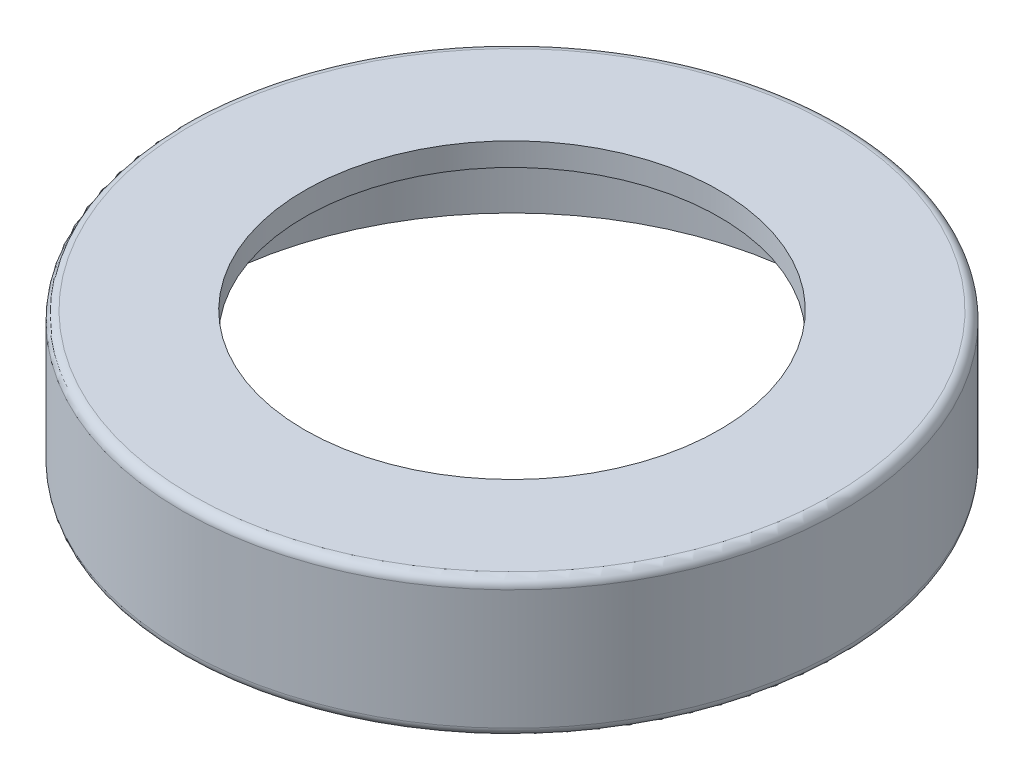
ISO-10303-21;
HEADER;
FILE_DESCRIPTION(('STEP AP214'),'2;1');
FILE_NAME('part.step','',(''),(''),'','','');
FILE_SCHEMA(('AUTOMOTIVE_DESIGN { 1 0 10303 214 1 1 1 1 }'));
ENDSEC;
DATA;
#1=APPLICATION_CONTEXT('core data for automotive mechanical design processes');
#2=APPLICATION_PROTOCOL_DEFINITION('international standard','automotive_design',2000,#1);
#3=PRODUCT_CONTEXT('',#1,'mechanical');
#4=PRODUCT('Part','Part','',(#3));
#5=PRODUCT_RELATED_PRODUCT_CATEGORY('part','',(#4));
#6=PRODUCT_DEFINITION_FORMATION('','',#4);
#7=PRODUCT_DEFINITION_CONTEXT('part definition',#1,'design');
#8=PRODUCT_DEFINITION('design','',#6,#7);
#9=PRODUCT_DEFINITION_SHAPE('','',#8);
#10=(LENGTH_UNIT() NAMED_UNIT(*) SI_UNIT(.MILLI.,.METRE.));
#11=(NAMED_UNIT(*) PLANE_ANGLE_UNIT() SI_UNIT($,.RADIAN.));
#12=(NAMED_UNIT(*) SI_UNIT($,.STERADIAN.) SOLID_ANGLE_UNIT());
#13=UNCERTAINTY_MEASURE_WITH_UNIT(LENGTH_MEASURE(1.E-05),#10,'distance_accuracy_value','');
#14=(GEOMETRIC_REPRESENTATION_CONTEXT(3) GLOBAL_UNCERTAINTY_ASSIGNED_CONTEXT((#13)) GLOBAL_UNIT_ASSIGNED_CONTEXT((#10,
#11,#12)) REPRESENTATION_CONTEXT('',''));
#15=CARTESIAN_POINT('',(0.,0.,0.));
#16=DIRECTION('',(0.,0.,1.));
#17=DIRECTION('',(1.,0.,0.));
#18=AXIS2_PLACEMENT_3D('',#15,#16,#17);
#19=CARTESIAN_POINT('',(6.95,3.,0.));
#20=DIRECTION('',(0.,-1.,0.));
#21=DIRECTION('',(0.,0.,-1.));
#22=AXIS2_PLACEMENT_3D('',#19,#20,#21);
#23=PLANE('',#22);
#24=CARTESIAN_POINT('',(0.,3.,0.));
#25=DIRECTION('',(0.,1.,0.));
#26=DIRECTION('',(0.,0.,1.));
#27=AXIS2_PLACEMENT_3D('',#24,#25,#26);
#28=CIRCLE('',#27,4.5);
#29=CARTESIAN_POINT('',(0.,3.,4.5));
#30=VERTEX_POINT('',#29);
#31=EDGE_CURVE('E10',#30,#30,#28,.T.);
#32=ORIENTED_EDGE('',*,*,#31,.F.);
#33=EDGE_LOOP('',(#32));
#34=FACE_BOUND('',#33,.T.);
#35=CARTESIAN_POINT('',(0.,3.,0.));
#36=DIRECTION('',(0.,1.,0.));
#37=DIRECTION('',(0.,0.,1.));
#38=AXIS2_PLACEMENT_3D('',#35,#36,#37);
#39=CIRCLE('',#38,6.95);
#40=CARTESIAN_POINT('',(0.,3.,6.95));
#41=VERTEX_POINT('',#40);
#42=EDGE_CURVE('E57',#41,#41,#39,.T.);
#43=ORIENTED_EDGE('',*,*,#42,.T.);
#44=EDGE_LOOP('',(#43));
#45=FACE_BOUND('',#44,.T.);
#46=ADVANCED_FACE('F29',(#34,#45),#23,.F.);
#47=CARTESIAN_POINT('',(0.,0.,0.));
#48=DIRECTION('',(0.,1.,0.));
#49=DIRECTION('',(0.,0.,1.));
#50=AXIS2_PLACEMENT_3D('',#47,#48,#49);
#51=CYLINDRICAL_SURFACE('',#50,4.5);
#52=CARTESIAN_POINT('',(0.,2.5,0.));
#53=DIRECTION('',(0.,1.,0.));
#54=DIRECTION('',(0.,0.,1.));
#55=AXIS2_PLACEMENT_3D('',#52,#53,#54);
#56=CIRCLE('',#55,4.5);
#57=CARTESIAN_POINT('',(0.,2.5,4.5));
#58=VERTEX_POINT('',#57);
#59=EDGE_CURVE('E35',#58,#58,#56,.T.);
#60=ORIENTED_EDGE('',*,*,#59,.F.);
#61=EDGE_LOOP('',(#60));
#62=FACE_BOUND('',#61,.T.);
#63=ORIENTED_EDGE('',*,*,#31,.T.);
#64=EDGE_LOOP('',(#63));
#65=FACE_BOUND('',#64,.T.);
#66=ADVANCED_FACE('F94',(#62,#65),#51,.F.);
#67=CARTESIAN_POINT('',(4.5,2.5,0.));
#68=DIRECTION('',(0.,1.,0.));
#69=DIRECTION('',(0.,0.,1.));
#70=AXIS2_PLACEMENT_3D('',#67,#68,#69);
#71=PLANE('',#70);
#72=CARTESIAN_POINT('',(0.,2.5,0.));
#73=DIRECTION('',(0.,1.,0.));
#74=DIRECTION('',(0.,0.,1.));
#75=AXIS2_PLACEMENT_3D('',#72,#73,#74);
#76=CIRCLE('',#75,6.825);
#77=CARTESIAN_POINT('',(0.,2.5,6.825));
#78=VERTEX_POINT('',#77);
#79=EDGE_CURVE('E39',#78,#78,#76,.T.);
#80=ORIENTED_EDGE('',*,*,#79,.F.);
#81=EDGE_LOOP('',(#80));
#82=FACE_BOUND('',#81,.T.);
#83=ORIENTED_EDGE('',*,*,#59,.T.);
#84=EDGE_LOOP('',(#83));
#85=FACE_BOUND('',#84,.T.);
#86=ADVANCED_FACE('F89',(#82,#85),#71,.F.);
#87=CARTESIAN_POINT('',(0.,0.,0.));
#88=DIRECTION('',(0.,1.,0.));
#89=DIRECTION('',(0.,0.,1.));
#90=AXIS2_PLACEMENT_3D('',#87,#88,#89);
#91=CYLINDRICAL_SURFACE('',#90,6.825);
#92=CARTESIAN_POINT('',(0.,0.,0.));
#93=DIRECTION('',(0.,1.,0.));
#94=DIRECTION('',(0.,0.,1.));
#95=AXIS2_PLACEMENT_3D('',#92,#93,#94);
#96=CIRCLE('',#95,6.825);
#97=CARTESIAN_POINT('',(0.,0.,6.825));
#98=VERTEX_POINT('',#97);
#99=EDGE_CURVE('E43',#98,#98,#96,.T.);
#100=ORIENTED_EDGE('',*,*,#99,.F.);
#101=EDGE_LOOP('',(#100));
#102=FACE_BOUND('',#101,.T.);
#103=ORIENTED_EDGE('',*,*,#79,.T.);
#104=EDGE_LOOP('',(#103));
#105=FACE_BOUND('',#104,.T.);
#106=ADVANCED_FACE('F83',(#102,#105),#91,.F.);
#107=CARTESIAN_POINT('',(6.825,0.,0.));
#108=DIRECTION('',(0.,1.,0.));
#109=DIRECTION('',(0.,0.,1.));
#110=AXIS2_PLACEMENT_3D('',#107,#108,#109);
#111=PLANE('',#110);
#112=CARTESIAN_POINT('',(0.,0.,0.));
#113=DIRECTION('',(0.,1.,0.));
#114=DIRECTION('',(0.,0.,1.));
#115=AXIS2_PLACEMENT_3D('',#112,#113,#114);
#116=CIRCLE('',#115,6.95);
#117=CARTESIAN_POINT('',(0.,0.,6.95));
#118=VERTEX_POINT('',#117);
#119=EDGE_CURVE('E48',#118,#118,#116,.T.);
#120=ORIENTED_EDGE('',*,*,#119,.F.);
#121=EDGE_LOOP('',(#120));
#122=FACE_BOUND('',#121,.T.);
#123=ORIENTED_EDGE('',*,*,#99,.T.);
#124=EDGE_LOOP('',(#123));
#125=FACE_BOUND('',#124,.T.);
#126=ADVANCED_FACE('F77',(#122,#125),#111,.F.);
#127=CARTESIAN_POINT('',(0.,0.200000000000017,0.));
#128=DIRECTION('',(0.,1.,0.));
#129=DIRECTION('',(0.,0.,1.));
#130=AXIS2_PLACEMENT_3D('',#127,#128,#129);
#131=TOROIDAL_SURFACE('',#130,6.94999999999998,0.200000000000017);
#132=CARTESIAN_POINT('',(0.,0.2,0.));
#133=DIRECTION('',(0.,1.,0.));
#134=DIRECTION('',(0.,0.,1.));
#135=AXIS2_PLACEMENT_3D('',#132,#133,#134);
#136=CIRCLE('',#135,7.15);
#137=CARTESIAN_POINT('',(0.,0.2,7.15));
#138=VERTEX_POINT('',#137);
#139=EDGE_CURVE('E51',#138,#138,#136,.T.);
#140=ORIENTED_EDGE('',*,*,#139,.F.);
#141=EDGE_LOOP('',(#140));
#142=FACE_BOUND('',#141,.T.);
#143=ORIENTED_EDGE('',*,*,#119,.T.);
#144=EDGE_LOOP('',(#143));
#145=FACE_BOUND('',#144,.T.);
#146=ADVANCED_FACE('F71',(#142,#145),#131,.T.);
#147=CARTESIAN_POINT('',(0.,0.,0.));
#148=DIRECTION('',(0.,1.,0.));
#149=DIRECTION('',(0.,0.,1.));
#150=AXIS2_PLACEMENT_3D('',#147,#148,#149);
#151=CYLINDRICAL_SURFACE('',#150,7.15);
#152=CARTESIAN_POINT('',(0.,2.8,0.));
#153=DIRECTION('',(0.,1.,0.));
#154=DIRECTION('',(0.,0.,1.));
#155=AXIS2_PLACEMENT_3D('',#152,#153,#154);
#156=CIRCLE('',#155,7.15);
#157=CARTESIAN_POINT('',(0.,2.8,7.15));
#158=VERTEX_POINT('',#157);
#159=EDGE_CURVE('E54',#158,#158,#156,.T.);
#160=ORIENTED_EDGE('',*,*,#159,.F.);
#161=EDGE_LOOP('',(#160));
#162=FACE_BOUND('',#161,.T.);
#163=ORIENTED_EDGE('',*,*,#139,.T.);
#164=EDGE_LOOP('',(#163));
#165=FACE_BOUND('',#164,.T.);
#166=ADVANCED_FACE('F65',(#162,#165),#151,.T.);
#167=CARTESIAN_POINT('',(0.,2.79999999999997,0.));
#168=DIRECTION('',(0.,1.,0.));
#169=DIRECTION('',(0.,0.,1.));
#170=AXIS2_PLACEMENT_3D('',#167,#168,#169);
#171=TOROIDAL_SURFACE('',#170,6.94999999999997,0.200000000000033);
#172=ORIENTED_EDGE('',*,*,#42,.F.);
#173=EDGE_LOOP('',(#172));
#174=FACE_BOUND('',#173,.T.);
#175=ORIENTED_EDGE('',*,*,#159,.T.);
#176=EDGE_LOOP('',(#175));
#177=FACE_BOUND('',#176,.T.);
#178=ADVANCED_FACE('F62',(#174,#177),#171,.T.);
#179=CLOSED_SHELL('',(#46,#66,#86,#106,#126,#146,#166,#178));
#180=MANIFOLD_SOLID_BREP('B2',#179);
#181=ADVANCED_BREP_SHAPE_REPRESENTATION('',(#18,#180),#14);
#182=SHAPE_DEFINITION_REPRESENTATION(#9,#181);
ENDSEC;
END-ISO-10303-21;
